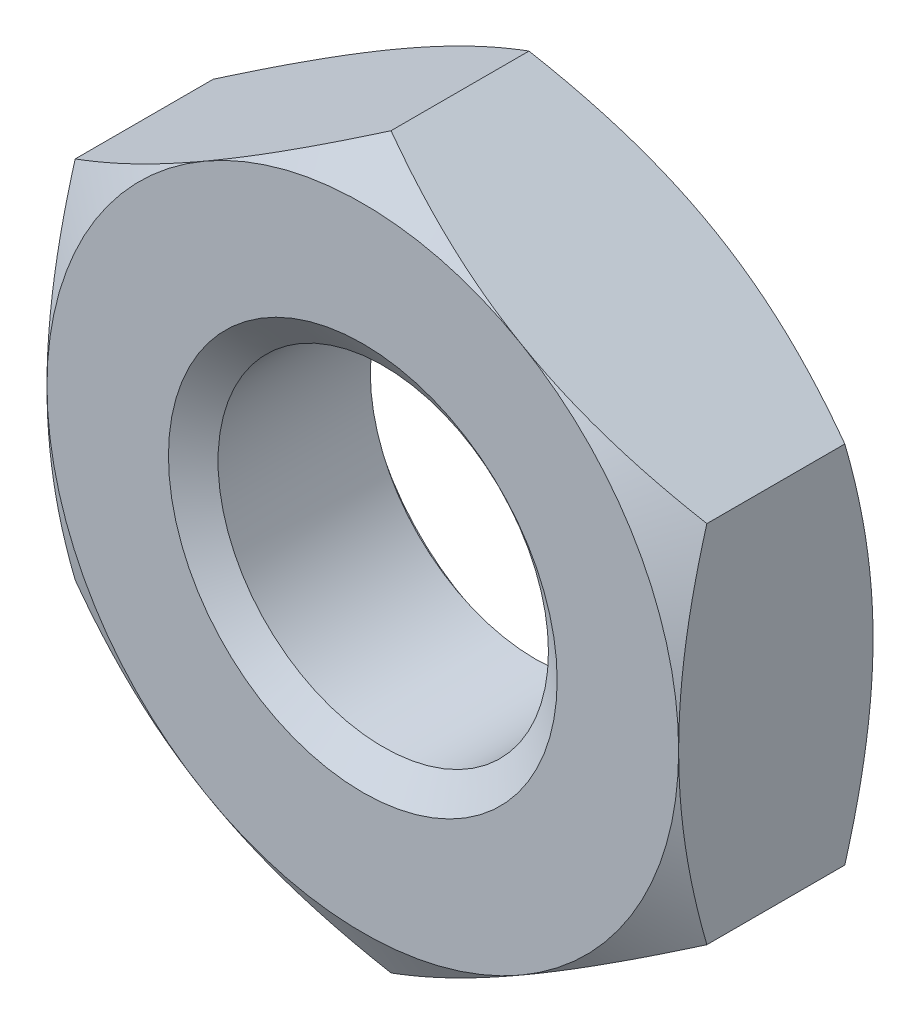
ISO-10303-21;
HEADER;
FILE_DESCRIPTION(('STEP AP214'),'2;1');
FILE_NAME('part.step','',(''),(''),'','','');
FILE_SCHEMA(('AUTOMOTIVE_DESIGN { 1 0 10303 214 1 1 1 1 }'));
ENDSEC;
DATA;
#1=APPLICATION_CONTEXT('core data for automotive mechanical design processes');
#2=APPLICATION_PROTOCOL_DEFINITION('international standard','automotive_design',2000,#1);
#3=PRODUCT_CONTEXT('',#1,'mechanical');
#4=PRODUCT('Part','Part','',(#3));
#5=PRODUCT_RELATED_PRODUCT_CATEGORY('part','',(#4));
#6=PRODUCT_DEFINITION_FORMATION('','',#4);
#7=PRODUCT_DEFINITION_CONTEXT('part definition',#1,'design');
#8=PRODUCT_DEFINITION('design','',#6,#7);
#9=PRODUCT_DEFINITION_SHAPE('','',#8);
#10=(LENGTH_UNIT() NAMED_UNIT(*) SI_UNIT(.MILLI.,.METRE.));
#11=(NAMED_UNIT(*) PLANE_ANGLE_UNIT() SI_UNIT($,.RADIAN.));
#12=(NAMED_UNIT(*) SI_UNIT($,.STERADIAN.) SOLID_ANGLE_UNIT());
#13=UNCERTAINTY_MEASURE_WITH_UNIT(LENGTH_MEASURE(1.E-05),#10,'distance_accuracy_value','');
#14=(GEOMETRIC_REPRESENTATION_CONTEXT(3) GLOBAL_UNCERTAINTY_ASSIGNED_CONTEXT((#13)) GLOBAL_UNIT_ASSIGNED_CONTEXT((#10,
#11,#12)) REPRESENTATION_CONTEXT('',''));
#15=CARTESIAN_POINT('',(0.,0.,0.));
#16=DIRECTION('',(0.,0.,1.));
#17=DIRECTION('',(1.,0.,0.));
#18=AXIS2_PLACEMENT_3D('',#15,#16,#17);
#19=CARTESIAN_POINT('',(0.,0.,-4.));
#20=DIRECTION('',(0.,0.,1.));
#21=DIRECTION('',(1.,0.,0.));
#22=AXIS2_PLACEMENT_3D('',#19,#20,#21);
#23=CYLINDRICAL_SURFACE('',#22,3.4);
#24=CARTESIAN_POINT('',(0.,0.,-0.420124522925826));
#25=DIRECTION('',(0.,0.,1.));
#26=DIRECTION('',(1.,0.,0.));
#27=AXIS2_PLACEMENT_3D('',#24,#25,#26);
#28=CIRCLE('',#27,3.4);
#29=CARTESIAN_POINT('',(3.4,0.,-0.420124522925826));
#30=VERTEX_POINT('',#29);
#31=EDGE_CURVE('E174',#30,#30,#28,.F.);
#32=ORIENTED_EDGE('',*,*,#31,.F.);
#33=EDGE_LOOP('',(#32));
#34=FACE_BOUND('',#33,.T.);
#35=CARTESIAN_POINT('',(0.,0.,-3.55447547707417));
#36=DIRECTION('',(0.,0.,-1.));
#37=DIRECTION('',(-1.,0.,0.));
#38=AXIS2_PLACEMENT_3D('',#35,#36,#37);
#39=CIRCLE('',#38,3.4);
#40=CARTESIAN_POINT('',(-3.4,0.,-3.55447547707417));
#41=VERTEX_POINT('',#40);
#42=EDGE_CURVE('E38',#41,#41,#39,.F.);
#43=ORIENTED_EDGE('',*,*,#42,.F.);
#44=EDGE_LOOP('',(#43));
#45=FACE_BOUND('',#44,.T.);
#46=ADVANCED_FACE('F33',(#34,#45),#23,.F.);
#47=CARTESIAN_POINT('',(0.,7.50555349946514,-4.));
#48=DIRECTION('',(-0.500000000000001,0.866025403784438,0.));
#49=DIRECTION('',(-0.866025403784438,-0.500000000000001,0.));
#50=AXIS2_PLACEMENT_3D('',#47,#48,#49);
#51=PLANE('',#50);
#52=DIRECTION('',(0.,0.,1.));
#53=VECTOR('',#52,1.);
#54=CARTESIAN_POINT('',(-6.5,3.75277674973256,-4.));
#55=LINE('',#54,#53);
#56=CARTESIAN_POINT('',(-6.5,3.75277674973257,-3.41944341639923));
#57=VERTEX_POINT('',#56);
#58=CARTESIAN_POINT('',(-6.5,3.75277674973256,-0.580556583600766));
#59=VERTEX_POINT('',#58);
#60=EDGE_CURVE('E164',#57,#59,#55,.T.);
#61=ORIENTED_EDGE('',*,*,#60,.T.);
#62=CARTESIAN_POINT('',(-6.5002,3.75266127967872,-0.58062325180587));
#63=CARTESIAN_POINT('',(-6.35732254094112,3.8351516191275,-0.533004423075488));
#64=CARTESIAN_POINT('',(-6.21391236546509,3.91794952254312,-0.487546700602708));
#65=CARTESIAN_POINT('',(-5.9259273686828,4.08421773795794,-0.401548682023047));
#66=CARTESIAN_POINT('',(-5.78135207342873,4.16768832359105,-0.361010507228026));
#67=CARTESIAN_POINT('',(-5.34531134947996,4.41943655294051,-0.247571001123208));
#68=CARTESIAN_POINT('',(-5.05212471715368,4.58870793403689,-0.183047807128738));
#69=CARTESIAN_POINT('',(-4.61337625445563,4.84201947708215,-0.107386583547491));
#70=CARTESIAN_POINT('',(-4.46912536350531,4.92530276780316,-0.085832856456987));
#71=CARTESIAN_POINT('',(-4.17997178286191,5.09224566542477,-0.0496903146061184));
#72=CARTESIAN_POINT('',(-4.03506915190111,5.17590523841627,-0.0351008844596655));
#73=CARTESIAN_POINT('',(-3.74501222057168,5.34336968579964,-0.0132587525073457));
#74=CARTESIAN_POINT('',(-3.59985839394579,5.427174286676,-0.00599772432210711));
#75=CARTESIAN_POINT('',(-3.30942466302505,5.59485627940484,0.00103969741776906));
#76=CARTESIAN_POINT('',(-3.16414476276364,5.6787336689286,0.000816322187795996));
#77=CARTESIAN_POINT('',(-2.7661240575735,5.90853103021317,-0.0100834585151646));
#78=CARTESIAN_POINT('',(-2.51351353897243,6.05437578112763,-0.0283818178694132));
#79=CARTESIAN_POINT('',(-2.00997032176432,6.34509659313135,-0.0864063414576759));
#80=CARTESIAN_POINT('',(-1.75903939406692,6.48997163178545,-0.126152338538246));
#81=CARTESIAN_POINT('',(-1.25448277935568,6.78127752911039,-0.225505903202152));
#82=CARTESIAN_POINT('',(-1.00092075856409,6.92767163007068,-0.28553442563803));
#83=CARTESIAN_POINT('',(-0.497578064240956,7.21827667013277,-0.421774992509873));
#84=CARTESIAN_POINT('',(-0.247790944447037,7.36249133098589,-0.497955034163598));
#85=CARTESIAN_POINT('',(0.000199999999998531,7.50566896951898,-0.580623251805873));
#86=B_SPLINE_CURVE_WITH_KNOTS('',3,(#62,#63,#64,#65,#66,#67,#68,#69,#70,#71,#72,#73,#74,#75,#76,
#77,#78,#79,#80,#81,#82,#83,#84,#85),.UNSPECIFIED.,.F.,.F.,(4,2,2,2,2,2,2,2,2,2,2,4),(0.,
0.515105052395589,1.03043143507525,2.06322554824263,2.56697389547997,3.07067772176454,
3.57380860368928,4.07692394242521,4.95279354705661,5.82947446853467,6.72559912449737,
7.61996451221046),.UNSPECIFIED.);
#87=CARTESIAN_POINT('',(-3.25000000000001,5.62916512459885,0.));
#88=VERTEX_POINT('',#87);
#89=EDGE_CURVE('E60',#59,#88,#86,.T.);
#90=ORIENTED_EDGE('',*,*,#89,.T.);
#91=CARTESIAN_POINT('',(0.,7.50555349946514,-0.580556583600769));
#92=VERTEX_POINT('',#91);
#93=EDGE_CURVE('E243',#88,#92,#86,.T.);
#94=ORIENTED_EDGE('',*,*,#93,.T.);
#95=DIRECTION('',(0.,0.,1.));
#96=VECTOR('',#95,1.);
#97=CARTESIAN_POINT('',(0.,7.50555349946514,-4.));
#98=LINE('',#97,#96);
#99=CARTESIAN_POINT('',(0.,7.50555349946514,-3.41944341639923));
#100=VERTEX_POINT('',#99);
#101=EDGE_CURVE('E149',#100,#92,#98,.T.);
#102=ORIENTED_EDGE('',*,*,#101,.F.);
#103=CARTESIAN_POINT('',(-6.5002,3.75266127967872,-3.41937674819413));
#104=CARTESIAN_POINT('',(-6.35732254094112,3.8351516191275,-3.46699557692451));
#105=CARTESIAN_POINT('',(-6.21391236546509,3.91794952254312,-3.51245329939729));
#106=CARTESIAN_POINT('',(-5.9259273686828,4.08421773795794,-3.59845131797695));
#107=CARTESIAN_POINT('',(-5.78135207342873,4.16768832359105,-3.63898949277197));
#108=CARTESIAN_POINT('',(-5.34531134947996,4.41943655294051,-3.75242899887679));
#109=CARTESIAN_POINT('',(-5.05212471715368,4.58870793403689,-3.81695219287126));
#110=CARTESIAN_POINT('',(-4.61337625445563,4.84201947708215,-3.89261341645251));
#111=CARTESIAN_POINT('',(-4.46912536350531,4.92530276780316,-3.91416714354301));
#112=CARTESIAN_POINT('',(-4.17997178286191,5.09224566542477,-3.95030968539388));
#113=CARTESIAN_POINT('',(-4.03506915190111,5.17590523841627,-3.96489911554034));
#114=CARTESIAN_POINT('',(-3.74501222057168,5.34336968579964,-3.98674124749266));
#115=CARTESIAN_POINT('',(-3.59985839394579,5.427174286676,-3.99400227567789));
#116=CARTESIAN_POINT('',(-3.30942466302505,5.59485627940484,-4.00103969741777));
#117=CARTESIAN_POINT('',(-3.16414476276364,5.6787336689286,-4.0008163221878));
#118=CARTESIAN_POINT('',(-2.7661240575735,5.90853103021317,-3.98991654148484));
#119=CARTESIAN_POINT('',(-2.51351353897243,6.05437578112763,-3.97161818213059));
#120=CARTESIAN_POINT('',(-2.00997032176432,6.34509659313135,-3.91359365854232));
#121=CARTESIAN_POINT('',(-1.75903939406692,6.48997163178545,-3.87384766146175));
#122=CARTESIAN_POINT('',(-1.25448277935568,6.78127752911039,-3.77449409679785));
#123=CARTESIAN_POINT('',(-1.00092075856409,6.92767163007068,-3.71446557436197));
#124=CARTESIAN_POINT('',(-0.497578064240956,7.21827667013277,-3.57822500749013));
#125=CARTESIAN_POINT('',(-0.247790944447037,7.36249133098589,-3.5020449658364));
#126=CARTESIAN_POINT('',(0.000199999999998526,7.50566896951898,-3.41937674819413));
#127=B_SPLINE_CURVE_WITH_KNOTS('',3,(#103,#104,#105,#106,#107,#108,#109,#110,#111,#112,#113,
#114,#115,#116,#117,#118,#119,#120,#121,#122,#123,#124,#125,#126),.UNSPECIFIED.,.F.,.F.,(4,2,2,
2,2,2,2,2,2,2,2,4),(0.,0.515105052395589,1.03043143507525,2.06322554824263,2.56697389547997,
3.07067772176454,3.57380860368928,4.07692394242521,4.95279354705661,5.82947446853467,
6.72559912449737,7.61996451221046),.UNSPECIFIED.);
#128=CARTESIAN_POINT('',(-3.25000000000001,5.62916512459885,-4.));
#129=VERTEX_POINT('',#128);
#130=EDGE_CURVE('E167',#129,#100,#127,.T.);
#131=ORIENTED_EDGE('',*,*,#130,.F.);
#132=EDGE_CURVE('E266',#57,#129,#127,.T.);
#133=ORIENTED_EDGE('',*,*,#132,.F.);
#134=EDGE_LOOP('',(#61,#90,#94,#102,#131,#133));
#135=FACE_BOUND('',#134,.T.);
#136=ADVANCED_FACE('F35',(#135),#51,.T.);
#137=CARTESIAN_POINT('',(6.5,3.75277674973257,-4.));
#138=DIRECTION('',(0.5,0.866025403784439,0.));
#139=DIRECTION('',(-0.866025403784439,0.5,0.));
#140=AXIS2_PLACEMENT_3D('',#137,#138,#139);
#141=PLANE('',#140);
#142=ORIENTED_EDGE('',*,*,#101,.T.);
#143=CARTESIAN_POINT('',(-0.000200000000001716,7.50566896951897,-0.580623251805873));
#144=CARTESIAN_POINT('',(0.142677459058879,7.4231786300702,-0.533004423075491));
#145=CARTESIAN_POINT('',(0.286087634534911,7.34038072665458,-0.487546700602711));
#146=CARTESIAN_POINT('',(0.574072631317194,7.17411251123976,-0.40154868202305));
#147=CARTESIAN_POINT('',(0.718647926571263,7.09064192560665,-0.361010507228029));
#148=CARTESIAN_POINT('',(1.15468865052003,6.83889369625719,-0.24757100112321));
#149=CARTESIAN_POINT('',(1.44787528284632,6.66962231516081,-0.18304780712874));
#150=CARTESIAN_POINT('',(1.88662374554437,6.41631077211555,-0.107386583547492));
#151=CARTESIAN_POINT('',(2.03087463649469,6.33302748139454,-0.0858328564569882));
#152=CARTESIAN_POINT('',(2.32002821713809,6.16608458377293,-0.0496903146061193));
#153=CARTESIAN_POINT('',(2.46493084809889,6.08242501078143,-0.0351008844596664));
#154=CARTESIAN_POINT('',(2.75498777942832,5.91496056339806,-0.0132587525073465));
#155=CARTESIAN_POINT('',(2.90014160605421,5.8311559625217,-0.00599772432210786));
#156=CARTESIAN_POINT('',(3.19057533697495,5.66347396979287,0.00103969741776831));
#157=CARTESIAN_POINT('',(3.33585523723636,5.5795965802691,0.000816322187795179));
#158=CARTESIAN_POINT('',(3.7338759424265,5.34979921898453,-0.0100834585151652));
#159=CARTESIAN_POINT('',(3.98648646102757,5.20395446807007,-0.0283818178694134));
#160=CARTESIAN_POINT('',(4.49002967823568,4.91323365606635,-0.0864063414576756));
#161=CARTESIAN_POINT('',(4.74096060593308,4.76835861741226,-0.126152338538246));
#162=CARTESIAN_POINT('',(5.24551722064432,4.47705272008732,-0.225505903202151));
#163=CARTESIAN_POINT('',(5.49907924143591,4.33065861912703,-0.285534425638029));
#164=CARTESIAN_POINT('',(6.00242193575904,4.04005357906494,-0.421774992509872));
#165=CARTESIAN_POINT('',(6.25220905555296,3.89583891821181,-0.497955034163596));
#166=CARTESIAN_POINT('',(6.5002,3.75266127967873,-0.580623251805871));
#167=B_SPLINE_CURVE_WITH_KNOTS('',3,(#143,#144,#145,#146,#147,#148,#149,#150,#151,#152,#153,
#154,#155,#156,#157,#158,#159,#160,#161,#162,#163,#164,#165,#166),.UNSPECIFIED.,.F.,.F.,(4,2,2,
2,2,2,2,2,2,2,2,4),(0.,0.515105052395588,1.03043143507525,2.06322554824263,2.56697389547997,
3.07067772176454,3.57380860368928,4.07692394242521,4.95279354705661,5.82947446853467,
6.72559912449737,7.61996451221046),.UNSPECIFIED.);
#168=CARTESIAN_POINT('',(3.25,5.62916512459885,0.));
#169=VERTEX_POINT('',#168);
#170=EDGE_CURVE('E142',#92,#169,#167,.T.);
#171=ORIENTED_EDGE('',*,*,#170,.T.);
#172=CARTESIAN_POINT('',(6.5,3.75277674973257,-0.580556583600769));
#173=VERTEX_POINT('',#172);
#174=EDGE_CURVE('E128',#169,#173,#167,.T.);
#175=ORIENTED_EDGE('',*,*,#174,.T.);
#176=DIRECTION('',(0.,0.,1.));
#177=VECTOR('',#176,1.);
#178=CARTESIAN_POINT('',(6.5,3.75277674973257,-4.));
#179=LINE('',#178,#177);
#180=CARTESIAN_POINT('',(6.5,3.75277674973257,-3.41944341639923));
#181=VERTEX_POINT('',#180);
#182=EDGE_CURVE('E141',#181,#173,#179,.T.);
#183=ORIENTED_EDGE('',*,*,#182,.F.);
#184=CARTESIAN_POINT('',(-0.000200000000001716,7.50566896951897,-3.41937674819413));
#185=CARTESIAN_POINT('',(0.142677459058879,7.4231786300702,-3.46699557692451));
#186=CARTESIAN_POINT('',(0.286087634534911,7.34038072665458,-3.51245329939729));
#187=CARTESIAN_POINT('',(0.574072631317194,7.17411251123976,-3.59845131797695));
#188=CARTESIAN_POINT('',(0.718647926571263,7.09064192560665,-3.63898949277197));
#189=CARTESIAN_POINT('',(1.15468865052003,6.83889369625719,-3.75242899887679));
#190=CARTESIAN_POINT('',(1.44787528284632,6.66962231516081,-3.81695219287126));
#191=CARTESIAN_POINT('',(1.88662374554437,6.41631077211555,-3.89261341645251));
#192=CARTESIAN_POINT('',(2.03087463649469,6.33302748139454,-3.91416714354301));
#193=CARTESIAN_POINT('',(2.32002821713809,6.16608458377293,-3.95030968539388));
#194=CARTESIAN_POINT('',(2.46493084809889,6.08242501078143,-3.96489911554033));
#195=CARTESIAN_POINT('',(2.75498777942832,5.91496056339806,-3.98674124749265));
#196=CARTESIAN_POINT('',(2.90014160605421,5.8311559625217,-3.99400227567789));
#197=CARTESIAN_POINT('',(3.19057533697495,5.66347396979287,-4.00103969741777));
#198=CARTESIAN_POINT('',(3.33585523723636,5.5795965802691,-4.0008163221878));
#199=CARTESIAN_POINT('',(3.7338759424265,5.34979921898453,-3.98991654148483));
#200=CARTESIAN_POINT('',(3.98648646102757,5.20395446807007,-3.97161818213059));
#201=CARTESIAN_POINT('',(4.49002967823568,4.91323365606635,-3.91359365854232));
#202=CARTESIAN_POINT('',(4.74096060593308,4.76835861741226,-3.87384766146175));
#203=CARTESIAN_POINT('',(5.24551722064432,4.47705272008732,-3.77449409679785));
#204=CARTESIAN_POINT('',(5.49907924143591,4.33065861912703,-3.71446557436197));
#205=CARTESIAN_POINT('',(6.00242193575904,4.04005357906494,-3.57822500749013));
#206=CARTESIAN_POINT('',(6.25220905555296,3.89583891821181,-3.5020449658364));
#207=CARTESIAN_POINT('',(6.5002,3.75266127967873,-3.41937674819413));
#208=B_SPLINE_CURVE_WITH_KNOTS('',3,(#184,#185,#186,#187,#188,#189,#190,#191,#192,#193,#194,
#195,#196,#197,#198,#199,#200,#201,#202,#203,#204,#205,#206,#207),.UNSPECIFIED.,.F.,.F.,(4,2,2,
2,2,2,2,2,2,2,2,4),(0.,0.515105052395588,1.03043143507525,2.06322554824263,2.56697389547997,
3.07067772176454,3.57380860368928,4.07692394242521,4.95279354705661,5.82947446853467,
6.72559912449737,7.61996451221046),.UNSPECIFIED.);
#209=CARTESIAN_POINT('',(3.25,5.62916512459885,-4.));
#210=VERTEX_POINT('',#209);
#211=EDGE_CURVE('E259',#210,#181,#208,.T.);
#212=ORIENTED_EDGE('',*,*,#211,.F.);
#213=EDGE_CURVE('E265',#100,#210,#208,.T.);
#214=ORIENTED_EDGE('',*,*,#213,.F.);
#215=EDGE_LOOP('',(#142,#171,#175,#183,#212,#214));
#216=FACE_BOUND('',#215,.T.);
#217=ADVANCED_FACE('F139',(#216),#141,.T.);
#218=CARTESIAN_POINT('',(6.5,3.75277674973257,-4.));
#219=DIRECTION('',(-1.,0.,0.));
#220=DIRECTION('',(0.,0.,1.));
#221=AXIS2_PLACEMENT_3D('',#218,#219,#220);
#222=PLANE('',#221);
#223=CARTESIAN_POINT('',(6.5,-9.95291698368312,-3.11042358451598));
#224=CARTESIAN_POINT('',(6.5,-9.66753022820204,-2.97250893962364));
#225=CARTESIAN_POINT('',(6.5,-9.38146872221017,-2.83596528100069));
#226=CARTESIAN_POINT('',(6.5,-8.80763137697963,-2.56640336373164));
#227=CARTESIAN_POINT('',(6.5,-8.51985525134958,-2.43338571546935));
#228=CARTESIAN_POINT('',(6.5,-7.94066929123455,-2.17095850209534));
#229=CARTESIAN_POINT('',(6.5,-7.64924808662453,-2.04157394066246));
#230=CARTESIAN_POINT('',(6.5,-7.06401043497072,-1.78836220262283));
#231=CARTESIAN_POINT('',(6.5,-6.77019411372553,-1.66453473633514));
#232=CARTESIAN_POINT('',(6.5,-6.17605150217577,-1.42244480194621));
#233=CARTESIAN_POINT('',(6.5,-5.87568957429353,-1.30426931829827));
#234=CARTESIAN_POINT('',(6.5,-5.27142269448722,-1.07717389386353));
#235=CARTESIAN_POINT('',(6.5,-4.96751735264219,-0.968254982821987));
#236=CARTESIAN_POINT('',(6.5,-4.3563054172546,-0.76259902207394));
#237=CARTESIAN_POINT('',(6.5,-4.04900762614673,-0.665836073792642));
#238=CARTESIAN_POINT('',(6.5,-3.43004022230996,-0.487635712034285));
#239=CARTESIAN_POINT('',(6.5,-3.11837202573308,-0.40619345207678));
#240=CARTESIAN_POINT('',(6.5,-2.49046594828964,-0.262584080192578));
#241=CARTESIAN_POINT('',(6.5,-2.17422687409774,-0.200422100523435));
#242=CARTESIAN_POINT('',(6.5,-1.5378916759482,-0.0995742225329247));
#243=CARTESIAN_POINT('',(6.5,-1.21779554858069,-0.0608883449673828));
#244=CARTESIAN_POINT('',(6.5,-0.737141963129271,-0.0229465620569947));
#245=CARTESIAN_POINT('',(6.5,-0.577336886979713,-0.013645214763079));
#246=CARTESIAN_POINT('',(6.5,-0.257468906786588,-0.00181408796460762));
#247=CARTESIAN_POINT('',(6.5,-0.097406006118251,0.000715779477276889));
#248=CARTESIAN_POINT('',(6.5,0.222635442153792,-0.00106401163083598));
#249=CARTESIAN_POINT('',(6.5,0.38261400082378,-0.00537175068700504));
#250=CARTESIAN_POINT('',(6.5,0.702250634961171,-0.0207175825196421));
#251=CARTESIAN_POINT('',(6.5,0.861908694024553,-0.0317560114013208));
#252=CARTESIAN_POINT('',(6.5,1.24887053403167,-0.06643686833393));
#253=CARTESIAN_POINT('',(6.5,1.47587694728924,-0.0934518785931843));
#254=CARTESIAN_POINT('',(6.5,1.92815030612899,-0.159589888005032));
#255=CARTESIAN_POINT('',(6.5,2.15341675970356,-0.198716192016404));
#256=CARTESIAN_POINT('',(6.5,2.60202427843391,-0.2876891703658));
#257=CARTESIAN_POINT('',(6.5,2.82536331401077,-0.337545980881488));
#258=CARTESIAN_POINT('',(6.5,3.26974354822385,-0.446458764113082));
#259=CARTESIAN_POINT('',(6.5,3.49078496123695,-0.505513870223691));
#260=CARTESIAN_POINT('',(6.5,3.93601414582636,-0.632954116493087));
#261=CARTESIAN_POINT('',(6.5,4.16014622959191,-0.701532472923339));
#262=CARTESIAN_POINT('',(6.5,4.60604131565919,-0.845465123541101));
#263=CARTESIAN_POINT('',(6.5,4.82780583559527,-0.920814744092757));
#264=CARTESIAN_POINT('',(6.5,5.26807593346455,-1.07673350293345));
#265=CARTESIAN_POINT('',(6.5,5.48659282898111,-1.15727087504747));
#266=CARTESIAN_POINT('',(6.5,5.9219312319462,-1.32307270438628));
#267=CARTESIAN_POINT('',(6.5,6.13875201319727,-1.40833907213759));
#268=CARTESIAN_POINT('',(6.5,6.35478510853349,-1.49550213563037));
#269=B_SPLINE_CURVE_WITH_KNOTS('',3,(#223,#224,#225,#226,#227,#228,#229,#230,#231,#232,#233,
#234,#235,#236,#237,#238,#239,#240,#241,#242,#243,#244,#245,#246,#247,#248,#249,#250,#251,#252,
#253,#254,#255,#256,#257,#258,#259,#260,#261,#262,#263,#264,#265,#266,#267,#268),.UNSPECIFIED.,
.F.,.F.,(4,2,2,2,2,2,2,2,2,2,2,2,2,2,2,2,2,2,2,2,2,2,4),(0.,0.950904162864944,1.90197187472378,
2.85848216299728,3.81494253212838,4.78314526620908,5.75145556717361,6.71766655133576,
7.68357137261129,8.64973308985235,9.61589566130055,10.0960003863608,10.5760988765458,
11.0560626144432,11.5360503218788,12.2214931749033,12.9071232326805,13.5934038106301,
14.2796197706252,14.9826563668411,15.6852113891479,16.3838119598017,17.082696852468),.UNSPECIFIED.);
#270=CARTESIAN_POINT('',(6.5,-3.75277674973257,-0.580556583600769));
#271=VERTEX_POINT('',#270);
#272=CARTESIAN_POINT('',(6.5,0.,0.));
#273=VERTEX_POINT('',#272);
#274=EDGE_CURVE('E134',#271,#273,#269,.T.);
#275=ORIENTED_EDGE('',*,*,#274,.F.);
#276=DIRECTION('',(0.,0.,1.));
#277=VECTOR('',#276,1.);
#278=CARTESIAN_POINT('',(6.5,-3.75277674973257,-4.));
#279=LINE('',#278,#277);
#280=CARTESIAN_POINT('',(6.5,-3.75277674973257,-3.41944341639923));
#281=VERTEX_POINT('',#280);
#282=EDGE_CURVE('E150',#281,#271,#279,.T.);
#283=ORIENTED_EDGE('',*,*,#282,.F.);
#284=CARTESIAN_POINT('',(6.5,-9.95291698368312,-0.889576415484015));
#285=CARTESIAN_POINT('',(6.5,-9.66753022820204,-1.02749106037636));
#286=CARTESIAN_POINT('',(6.5,-9.38146872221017,-1.16403471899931));
#287=CARTESIAN_POINT('',(6.5,-8.80763137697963,-1.43359663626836));
#288=CARTESIAN_POINT('',(6.5,-8.51985525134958,-1.56661428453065));
#289=CARTESIAN_POINT('',(6.5,-7.94066929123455,-1.82904149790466));
#290=CARTESIAN_POINT('',(6.5,-7.64924808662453,-1.95842605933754));
#291=CARTESIAN_POINT('',(6.5,-7.06401043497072,-2.21163779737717));
#292=CARTESIAN_POINT('',(6.5,-6.77019411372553,-2.33546526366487));
#293=CARTESIAN_POINT('',(6.5,-6.17605150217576,-2.57755519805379));
#294=CARTESIAN_POINT('',(6.5,-5.87568957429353,-2.69573068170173));
#295=CARTESIAN_POINT('',(6.5,-5.27142269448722,-2.92282610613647));
#296=CARTESIAN_POINT('',(6.5,-4.96751735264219,-3.03174501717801));
#297=CARTESIAN_POINT('',(6.5,-4.3563054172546,-3.23740097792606));
#298=CARTESIAN_POINT('',(6.5,-4.04900762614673,-3.33416392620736));
#299=CARTESIAN_POINT('',(6.5,-3.43004022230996,-3.51236428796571));
#300=CARTESIAN_POINT('',(6.5,-3.11837202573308,-3.59380654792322));
#301=CARTESIAN_POINT('',(6.5,-2.49046594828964,-3.73741591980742));
#302=CARTESIAN_POINT('',(6.5,-2.17422687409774,-3.79957789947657));
#303=CARTESIAN_POINT('',(6.5,-1.5378916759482,-3.90042577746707));
#304=CARTESIAN_POINT('',(6.5,-1.21779554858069,-3.93911165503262));
#305=CARTESIAN_POINT('',(6.5,-0.737141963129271,-3.97705343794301));
#306=CARTESIAN_POINT('',(6.5,-0.577336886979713,-3.98635478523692));
#307=CARTESIAN_POINT('',(6.5,-0.257468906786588,-3.99818591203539));
#308=CARTESIAN_POINT('',(6.5,-0.0974060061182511,-4.00071577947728));
#309=CARTESIAN_POINT('',(6.5,0.222635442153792,-3.99893598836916));
#310=CARTESIAN_POINT('',(6.5,0.382614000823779,-3.99462824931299));
#311=CARTESIAN_POINT('',(6.5,0.702250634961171,-3.97928241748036));
#312=CARTESIAN_POINT('',(6.5,0.861908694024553,-3.96824398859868));
#313=CARTESIAN_POINT('',(6.5,1.24887053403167,-3.93356313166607));
#314=CARTESIAN_POINT('',(6.5,1.47587694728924,-3.90654812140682));
#315=CARTESIAN_POINT('',(6.5,1.92815030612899,-3.84041011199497));
#316=CARTESIAN_POINT('',(6.5,2.15341675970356,-3.8012838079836));
#317=CARTESIAN_POINT('',(6.5,2.60202427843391,-3.7123108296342));
#318=CARTESIAN_POINT('',(6.5,2.82536331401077,-3.66245401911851));
#319=CARTESIAN_POINT('',(6.5,3.26974354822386,-3.55354123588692));
#320=CARTESIAN_POINT('',(6.5,3.49078496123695,-3.49448612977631));
#321=CARTESIAN_POINT('',(6.5,3.93601414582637,-3.36704588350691));
#322=CARTESIAN_POINT('',(6.5,4.16014622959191,-3.29846752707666));
#323=CARTESIAN_POINT('',(6.5,4.60604131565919,-3.1545348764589));
#324=CARTESIAN_POINT('',(6.5,4.82780583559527,-3.07918525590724));
#325=CARTESIAN_POINT('',(6.5,5.26807593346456,-2.92326649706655));
#326=CARTESIAN_POINT('',(6.5,5.48659282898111,-2.84272912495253));
#327=CARTESIAN_POINT('',(6.5,5.9219312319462,-2.67692729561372));
#328=CARTESIAN_POINT('',(6.5,6.13875201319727,-2.59166092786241));
#329=CARTESIAN_POINT('',(6.5,6.35478510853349,-2.50449786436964));
#330=B_SPLINE_CURVE_WITH_KNOTS('',3,(#284,#285,#286,#287,#288,#289,#290,#291,#292,#293,#294,
#295,#296,#297,#298,#299,#300,#301,#302,#303,#304,#305,#306,#307,#308,#309,#310,#311,#312,#313,
#314,#315,#316,#317,#318,#319,#320,#321,#322,#323,#324,#325,#326,#327,#328,#329),.UNSPECIFIED.,
.F.,.F.,(4,2,2,2,2,2,2,2,2,2,2,2,2,2,2,2,2,2,2,2,2,2,4),(0.,0.950904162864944,1.90197187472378,
2.85848216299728,3.81494253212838,4.78314526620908,5.75145556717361,6.71766655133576,
7.68357137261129,8.64973308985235,9.61589566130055,10.0960003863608,10.5760988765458,
11.0560626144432,11.5360503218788,12.2214931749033,12.9071232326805,13.5934038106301,
14.2796197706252,14.9826563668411,15.6852113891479,16.3838119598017,17.082696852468),.UNSPECIFIED.);
#331=CARTESIAN_POINT('',(6.5,0.,-4.));
#332=VERTEX_POINT('',#331);
#333=EDGE_CURVE('E272',#281,#332,#330,.T.);
#334=ORIENTED_EDGE('',*,*,#333,.T.);
#335=EDGE_CURVE('E148',#332,#181,#330,.T.);
#336=ORIENTED_EDGE('',*,*,#335,.T.);
#337=ORIENTED_EDGE('',*,*,#182,.T.);
#338=EDGE_CURVE('E125',#273,#173,#269,.T.);
#339=ORIENTED_EDGE('',*,*,#338,.F.);
#340=EDGE_LOOP('',(#275,#283,#334,#336,#337,#339));
#341=FACE_BOUND('',#340,.T.);
#342=ADVANCED_FACE('F145',(#341),#222,.F.);
#343=CARTESIAN_POINT('',(0.,-7.50555349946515,-4.));
#344=DIRECTION('',(0.500000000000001,-0.866025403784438,0.));
#345=DIRECTION('',(0.866025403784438,0.500000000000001,0.));
#346=AXIS2_PLACEMENT_3D('',#343,#344,#345);
#347=PLANE('',#346);
#348=ORIENTED_EDGE('',*,*,#282,.T.);
#349=CARTESIAN_POINT('',(6.5002,-3.75266127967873,-0.580623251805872));
#350=CARTESIAN_POINT('',(6.35732254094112,-3.83515161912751,-0.53300442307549));
#351=CARTESIAN_POINT('',(6.21391236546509,-3.91794952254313,-0.487546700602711));
#352=CARTESIAN_POINT('',(5.9259273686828,-4.08421773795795,-0.40154868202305));
#353=CARTESIAN_POINT('',(5.78135207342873,-4.16768832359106,-0.361010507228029));
#354=CARTESIAN_POINT('',(5.34531134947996,-4.41943655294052,-0.247571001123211));
#355=CARTESIAN_POINT('',(5.05212471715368,-4.5887079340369,-0.183047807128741));
#356=CARTESIAN_POINT('',(4.61337625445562,-4.84201947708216,-0.107386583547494));
#357=CARTESIAN_POINT('',(4.46912536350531,-4.92530276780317,-0.0858328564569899));
#358=CARTESIAN_POINT('',(4.17997178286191,-5.09224566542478,-0.0496903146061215));
#359=CARTESIAN_POINT('',(4.03506915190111,-5.17590523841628,-0.0351008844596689));
#360=CARTESIAN_POINT('',(3.74501222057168,-5.34336968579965,-0.0132587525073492));
#361=CARTESIAN_POINT('',(3.59985839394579,-5.42717428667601,-0.00599772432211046));
#362=CARTESIAN_POINT('',(3.30942466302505,-5.59485627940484,0.0010396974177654));
#363=CARTESIAN_POINT('',(3.16414476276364,-5.67873366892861,0.000816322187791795));
#364=CARTESIAN_POINT('',(2.7661240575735,-5.90853103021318,-0.0100834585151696));
#365=CARTESIAN_POINT('',(2.51351353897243,-6.05437578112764,-0.028381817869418));
#366=CARTESIAN_POINT('',(2.00997032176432,-6.34509659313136,-0.0864063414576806));
#367=CARTESIAN_POINT('',(1.75903939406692,-6.48997163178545,-0.126152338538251));
#368=CARTESIAN_POINT('',(1.25448277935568,-6.78127752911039,-0.225505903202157));
#369=CARTESIAN_POINT('',(1.00092075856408,-6.92767163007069,-0.285534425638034));
#370=CARTESIAN_POINT('',(0.497578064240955,-7.21827667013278,-0.421774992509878));
#371=CARTESIAN_POINT('',(0.247790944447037,-7.3624913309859,-0.497955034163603));
#372=CARTESIAN_POINT('',(-0.000199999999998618,-7.50566896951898,-0.580623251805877));
#373=B_SPLINE_CURVE_WITH_KNOTS('',3,(#349,#350,#351,#352,#353,#354,#355,#356,#357,#358,#359,
#360,#361,#362,#363,#364,#365,#366,#367,#368,#369,#370,#371,#372),.UNSPECIFIED.,.F.,.F.,(4,2,2,
2,2,2,2,2,2,2,2,4),(0.,0.515105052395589,1.03043143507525,2.06322554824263,2.56697389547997,
3.07067772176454,3.57380860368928,4.07692394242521,4.95279354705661,5.82947446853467,
6.72559912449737,7.61996451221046),.UNSPECIFIED.);
#374=CARTESIAN_POINT('',(3.25000000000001,-5.62916512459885,0.));
#375=VERTEX_POINT('',#374);
#376=EDGE_CURVE('E545',#271,#375,#373,.T.);
#377=ORIENTED_EDGE('',*,*,#376,.T.);
#378=CARTESIAN_POINT('',(0.,-7.50555349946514,-0.580556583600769));
#379=VERTEX_POINT('',#378);
#380=EDGE_CURVE('E227',#375,#379,#373,.T.);
#381=ORIENTED_EDGE('',*,*,#380,.T.);
#382=DIRECTION('',(0.,0.,1.));
#383=VECTOR('',#382,1.);
#384=CARTESIAN_POINT('',(0.,-7.50555349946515,-4.));
#385=LINE('',#384,#383);
#386=CARTESIAN_POINT('',(0.,-7.50555349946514,-3.41944341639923));
#387=VERTEX_POINT('',#386);
#388=EDGE_CURVE('E155',#387,#379,#385,.T.);
#389=ORIENTED_EDGE('',*,*,#388,.F.);
#390=CARTESIAN_POINT('',(6.5002,-3.75266127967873,-3.41937674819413));
#391=CARTESIAN_POINT('',(6.35732254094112,-3.83515161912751,-3.46699557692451));
#392=CARTESIAN_POINT('',(6.21391236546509,-3.91794952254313,-3.51245329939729));
#393=CARTESIAN_POINT('',(5.9259273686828,-4.08421773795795,-3.59845131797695));
#394=CARTESIAN_POINT('',(5.78135207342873,-4.16768832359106,-3.63898949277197));
#395=CARTESIAN_POINT('',(5.34531134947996,-4.41943655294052,-3.75242899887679));
#396=CARTESIAN_POINT('',(5.05212471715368,-4.5887079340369,-3.81695219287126));
#397=CARTESIAN_POINT('',(4.61337625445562,-4.84201947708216,-3.89261341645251));
#398=CARTESIAN_POINT('',(4.46912536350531,-4.92530276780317,-3.91416714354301));
#399=CARTESIAN_POINT('',(4.17997178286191,-5.09224566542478,-3.95030968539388));
#400=CARTESIAN_POINT('',(4.03506915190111,-5.17590523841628,-3.96489911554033));
#401=CARTESIAN_POINT('',(3.74501222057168,-5.34336968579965,-3.98674124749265));
#402=CARTESIAN_POINT('',(3.59985839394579,-5.42717428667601,-3.99400227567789));
#403=CARTESIAN_POINT('',(3.30942466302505,-5.59485627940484,-4.00103969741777));
#404=CARTESIAN_POINT('',(3.16414476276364,-5.67873366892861,-4.00081632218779));
#405=CARTESIAN_POINT('',(2.7661240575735,-5.90853103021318,-3.98991654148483));
#406=CARTESIAN_POINT('',(2.51351353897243,-6.05437578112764,-3.97161818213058));
#407=CARTESIAN_POINT('',(2.00997032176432,-6.34509659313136,-3.91359365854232));
#408=CARTESIAN_POINT('',(1.75903939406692,-6.48997163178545,-3.87384766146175));
#409=CARTESIAN_POINT('',(1.25448277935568,-6.78127752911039,-3.77449409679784));
#410=CARTESIAN_POINT('',(1.00092075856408,-6.92767163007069,-3.71446557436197));
#411=CARTESIAN_POINT('',(0.497578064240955,-7.21827667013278,-3.57822500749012));
#412=CARTESIAN_POINT('',(0.247790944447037,-7.3624913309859,-3.5020449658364));
#413=CARTESIAN_POINT('',(-0.000199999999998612,-7.50566896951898,-3.41937674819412));
#414=B_SPLINE_CURVE_WITH_KNOTS('',3,(#390,#391,#392,#393,#394,#395,#396,#397,#398,#399,#400,
#401,#402,#403,#404,#405,#406,#407,#408,#409,#410,#411,#412,#413),.UNSPECIFIED.,.F.,.F.,(4,2,2,
2,2,2,2,2,2,2,2,4),(0.,0.515105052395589,1.03043143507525,2.06322554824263,2.56697389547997,
3.07067772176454,3.57380860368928,4.07692394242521,4.95279354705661,5.82947446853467,
6.72559912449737,7.61996451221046),.UNSPECIFIED.);
#415=CARTESIAN_POINT('',(3.25000000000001,-5.62916512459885,-4.));
#416=VERTEX_POINT('',#415);
#417=EDGE_CURVE('E279',#416,#387,#414,.T.);
#418=ORIENTED_EDGE('',*,*,#417,.F.);
#419=EDGE_CURVE('E278',#281,#416,#414,.T.);
#420=ORIENTED_EDGE('',*,*,#419,.F.);
#421=EDGE_LOOP('',(#348,#377,#381,#389,#418,#420));
#422=FACE_BOUND('',#421,.T.);
#423=ADVANCED_FACE('F291',(#422),#347,.T.);
#424=CARTESIAN_POINT('',(-6.5,-3.75277674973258,-4.));
#425=DIRECTION('',(-0.5,-0.866025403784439,0.));
#426=DIRECTION('',(0.866025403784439,-0.5,0.));
#427=AXIS2_PLACEMENT_3D('',#424,#425,#426);
#428=PLANE('',#427);
#429=ORIENTED_EDGE('',*,*,#388,.T.);
#430=CARTESIAN_POINT('',(0.00020000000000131,-7.50566896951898,-0.580623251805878));
#431=CARTESIAN_POINT('',(-0.142677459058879,-7.42317863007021,-0.533004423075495));
#432=CARTESIAN_POINT('',(-0.286087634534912,-7.34038072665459,-0.487546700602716));
#433=CARTESIAN_POINT('',(-0.574072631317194,-7.17411251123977,-0.401548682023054));
#434=CARTESIAN_POINT('',(-0.718647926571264,-7.09064192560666,-0.361010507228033));
#435=CARTESIAN_POINT('',(-1.15468865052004,-6.8388936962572,-0.247571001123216));
#436=CARTESIAN_POINT('',(-1.44787528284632,-6.66962231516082,-0.183047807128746));
#437=CARTESIAN_POINT('',(-1.88662374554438,-6.41631077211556,-0.107386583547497));
#438=CARTESIAN_POINT('',(-2.03087463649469,-6.33302748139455,-0.0858328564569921));
#439=CARTESIAN_POINT('',(-2.32002821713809,-6.16608458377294,-0.0496903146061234));
#440=CARTESIAN_POINT('',(-2.46493084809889,-6.08242501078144,-0.0351008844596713));
#441=CARTESIAN_POINT('',(-2.75498777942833,-5.91496056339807,-0.0132587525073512));
#442=CARTESIAN_POINT('',(-2.90014160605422,-5.83115596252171,-0.00599772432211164));
#443=CARTESIAN_POINT('',(-3.19057533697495,-5.66347396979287,0.00103969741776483));
#444=CARTESIAN_POINT('',(-3.33585523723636,-5.57959658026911,0.000816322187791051));
#445=CARTESIAN_POINT('',(-3.7338759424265,-5.34979921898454,-0.01008345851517));
#446=CARTESIAN_POINT('',(-3.98648646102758,-5.20395446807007,-0.0283818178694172));
#447=CARTESIAN_POINT('',(-4.49002967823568,-4.91323365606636,-0.0864063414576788));
#448=CARTESIAN_POINT('',(-4.74096060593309,-4.76835861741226,-0.126152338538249));
#449=CARTESIAN_POINT('',(-5.24551722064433,-4.47705272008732,-0.225505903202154));
#450=CARTESIAN_POINT('',(-5.49907924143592,-4.33065861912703,-0.285534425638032));
#451=CARTESIAN_POINT('',(-6.00242193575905,-4.04005357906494,-0.421774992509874));
#452=CARTESIAN_POINT('',(-6.25220905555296,-3.89583891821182,-0.497955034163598));
#453=CARTESIAN_POINT('',(-6.5002,-3.75266127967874,-0.580623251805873));
#454=B_SPLINE_CURVE_WITH_KNOTS('',3,(#430,#431,#432,#433,#434,#435,#436,#437,#438,#439,#440,
#441,#442,#443,#444,#445,#446,#447,#448,#449,#450,#451,#452,#453),.UNSPECIFIED.,.F.,.F.,(4,2,2,
2,2,2,2,2,2,2,2,4),(0.,0.515105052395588,1.03043143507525,2.06322554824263,2.56697389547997,
3.07067772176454,3.57380860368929,4.07692394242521,4.95279354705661,5.82947446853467,
6.72559912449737,7.61996451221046),.UNSPECIFIED.);
#455=CARTESIAN_POINT('',(-3.25,-5.62916512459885,0.));
#456=VERTEX_POINT('',#455);
#457=EDGE_CURVE('E543',#379,#456,#454,.T.);
#458=ORIENTED_EDGE('',*,*,#457,.T.);
#459=CARTESIAN_POINT('',(-6.5,-3.75277674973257,-0.580556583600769));
#460=VERTEX_POINT('',#459);
#461=EDGE_CURVE('E199',#456,#460,#454,.T.);
#462=ORIENTED_EDGE('',*,*,#461,.T.);
#463=DIRECTION('',(0.,0.,1.));
#464=VECTOR('',#463,1.);
#465=CARTESIAN_POINT('',(-6.5,-3.75277674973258,-4.));
#466=LINE('',#465,#464);
#467=CARTESIAN_POINT('',(-6.5,-3.75277674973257,-3.41944341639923));
#468=VERTEX_POINT('',#467);
#469=EDGE_CURVE('E161',#468,#460,#466,.T.);
#470=ORIENTED_EDGE('',*,*,#469,.F.);
#471=CARTESIAN_POINT('',(0.00020000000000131,-7.50566896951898,-3.41937674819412));
#472=CARTESIAN_POINT('',(-0.142677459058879,-7.42317863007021,-3.4669955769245));
#473=CARTESIAN_POINT('',(-0.286087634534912,-7.34038072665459,-3.51245329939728));
#474=CARTESIAN_POINT('',(-0.574072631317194,-7.17411251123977,-3.59845131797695));
#475=CARTESIAN_POINT('',(-0.718647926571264,-7.09064192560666,-3.63898949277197));
#476=CARTESIAN_POINT('',(-1.15468865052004,-6.8388936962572,-3.75242899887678));
#477=CARTESIAN_POINT('',(-1.44787528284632,-6.66962231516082,-3.81695219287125));
#478=CARTESIAN_POINT('',(-1.88662374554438,-6.41631077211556,-3.8926134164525));
#479=CARTESIAN_POINT('',(-2.03087463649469,-6.33302748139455,-3.91416714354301));
#480=CARTESIAN_POINT('',(-2.32002821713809,-6.16608458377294,-3.95030968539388));
#481=CARTESIAN_POINT('',(-2.46493084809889,-6.08242501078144,-3.96489911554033));
#482=CARTESIAN_POINT('',(-2.75498777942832,-5.91496056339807,-3.98674124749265));
#483=CARTESIAN_POINT('',(-2.90014160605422,-5.83115596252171,-3.99400227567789));
#484=CARTESIAN_POINT('',(-3.19057533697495,-5.66347396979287,-4.00103969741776));
#485=CARTESIAN_POINT('',(-3.33585523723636,-5.57959658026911,-4.00081632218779));
#486=CARTESIAN_POINT('',(-3.7338759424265,-5.34979921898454,-3.98991654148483));
#487=CARTESIAN_POINT('',(-3.98648646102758,-5.20395446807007,-3.97161818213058));
#488=CARTESIAN_POINT('',(-4.49002967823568,-4.91323365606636,-3.91359365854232));
#489=CARTESIAN_POINT('',(-4.74096060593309,-4.76835861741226,-3.87384766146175));
#490=CARTESIAN_POINT('',(-5.24551722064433,-4.47705272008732,-3.77449409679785));
#491=CARTESIAN_POINT('',(-5.49907924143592,-4.33065861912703,-3.71446557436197));
#492=CARTESIAN_POINT('',(-6.00242193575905,-4.04005357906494,-3.57822500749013));
#493=CARTESIAN_POINT('',(-6.25220905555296,-3.89583891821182,-3.5020449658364));
#494=CARTESIAN_POINT('',(-6.5002,-3.75266127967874,-3.41937674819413));
#495=B_SPLINE_CURVE_WITH_KNOTS('',3,(#471,#472,#473,#474,#475,#476,#477,#478,#479,#480,#481,
#482,#483,#484,#485,#486,#487,#488,#489,#490,#491,#492,#493,#494),.UNSPECIFIED.,.F.,.F.,(4,2,2,
2,2,2,2,2,2,2,2,4),(0.,0.515105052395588,1.03043143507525,2.06322554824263,2.56697389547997,
3.07067772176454,3.57380860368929,4.07692394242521,4.95279354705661,5.82947446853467,
6.72559912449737,7.61996451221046),.UNSPECIFIED.);
#496=CARTESIAN_POINT('',(-3.25,-5.62916512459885,-4.));
#497=VERTEX_POINT('',#496);
#498=EDGE_CURVE('E286',#497,#468,#495,.T.);
#499=ORIENTED_EDGE('',*,*,#498,.F.);
#500=EDGE_CURVE('E285',#387,#497,#495,.T.);
#501=ORIENTED_EDGE('',*,*,#500,.F.);
#502=EDGE_LOOP('',(#429,#458,#462,#470,#499,#501));
#503=FACE_BOUND('',#502,.T.);
#504=ADVANCED_FACE('F294',(#503),#428,.T.);
#505=CARTESIAN_POINT('',(-6.5,3.75277674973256,-4.));
#506=DIRECTION('',(-1.,0.,0.));
#507=DIRECTION('',(0.,0.,1.));
#508=AXIS2_PLACEMENT_3D('',#505,#506,#507);
#509=PLANE('',#508);
#510=ORIENTED_EDGE('',*,*,#469,.T.);
#511=CARTESIAN_POINT('',(-6.5,-9.95291698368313,-3.11042358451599));
#512=CARTESIAN_POINT('',(-6.5,-9.66753022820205,-2.97250893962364));
#513=CARTESIAN_POINT('',(-6.5,-9.38146872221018,-2.8359652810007));
#514=CARTESIAN_POINT('',(-6.5,-8.80763137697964,-2.56640336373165));
#515=CARTESIAN_POINT('',(-6.5,-8.51985525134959,-2.43338571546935));
#516=CARTESIAN_POINT('',(-6.5,-7.94066929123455,-2.17095850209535));
#517=CARTESIAN_POINT('',(-6.5,-7.64924808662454,-2.04157394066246));
#518=CARTESIAN_POINT('',(-6.5,-7.06401043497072,-1.78836220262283));
#519=CARTESIAN_POINT('',(-6.5,-6.77019411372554,-1.66453473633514));
#520=CARTESIAN_POINT('',(-6.5,-6.17605150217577,-1.42244480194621));
#521=CARTESIAN_POINT('',(-6.5,-5.87568957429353,-1.30426931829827));
#522=CARTESIAN_POINT('',(-6.5,-5.27142269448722,-1.07717389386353));
#523=CARTESIAN_POINT('',(-6.5,-4.96751735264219,-0.968254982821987));
#524=CARTESIAN_POINT('',(-6.5,-4.35630541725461,-0.76259902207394));
#525=CARTESIAN_POINT('',(-6.5,-4.04900762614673,-0.665836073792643));
#526=CARTESIAN_POINT('',(-6.5,-3.43004022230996,-0.487635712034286));
#527=CARTESIAN_POINT('',(-6.5,-3.11837202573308,-0.406193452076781));
#528=CARTESIAN_POINT('',(-6.5,-2.49046594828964,-0.262584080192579));
#529=CARTESIAN_POINT('',(-6.5,-2.17422687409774,-0.200422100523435));
#530=CARTESIAN_POINT('',(-6.5,-1.5378916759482,-0.0995742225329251));
#531=CARTESIAN_POINT('',(-6.5,-1.2177955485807,-0.0608883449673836));
#532=CARTESIAN_POINT('',(-6.5,-0.737141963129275,-0.0229465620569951));
#533=CARTESIAN_POINT('',(-6.5,-0.577336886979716,-0.0136452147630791));
#534=CARTESIAN_POINT('',(-6.5,-0.257468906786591,-0.00181408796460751));
#535=CARTESIAN_POINT('',(-6.5,-0.0974060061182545,0.000715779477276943));
#536=CARTESIAN_POINT('',(-6.5,0.222635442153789,-0.00106401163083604));
#537=CARTESIAN_POINT('',(-6.5,0.382614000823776,-0.00537175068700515));
#538=CARTESIAN_POINT('',(-6.5,0.702250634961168,-0.020717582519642));
#539=CARTESIAN_POINT('',(-6.5,0.861908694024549,-0.0317560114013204));
#540=CARTESIAN_POINT('',(-6.5,1.24887053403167,-0.0664368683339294));
#541=CARTESIAN_POINT('',(-6.5,1.47587694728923,-0.0934518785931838));
#542=CARTESIAN_POINT('',(-6.5,1.92815030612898,-0.159589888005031));
#543=CARTESIAN_POINT('',(-6.5,2.15341675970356,-0.198716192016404));
#544=CARTESIAN_POINT('',(-6.5,2.60202427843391,-0.2876891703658));
#545=CARTESIAN_POINT('',(-6.5,2.82536331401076,-0.337545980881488));
#546=CARTESIAN_POINT('',(-6.5,3.26974354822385,-0.446458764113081));
#547=CARTESIAN_POINT('',(-6.5,3.49078496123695,-0.505513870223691));
#548=CARTESIAN_POINT('',(-6.5,3.93601414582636,-0.632954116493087));
#549=CARTESIAN_POINT('',(-6.5,4.16014622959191,-0.701532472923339));
#550=CARTESIAN_POINT('',(-6.5,4.60604131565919,-0.845465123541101));
#551=CARTESIAN_POINT('',(-6.5,4.82780583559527,-0.920814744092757));
#552=CARTESIAN_POINT('',(-6.5,5.26807593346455,-1.07673350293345));
#553=CARTESIAN_POINT('',(-6.5,5.48659282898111,-1.15727087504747));
#554=CARTESIAN_POINT('',(-6.5,5.9219312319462,-1.32307270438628));
#555=CARTESIAN_POINT('',(-6.5,6.13875201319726,-1.40833907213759));
#556=CARTESIAN_POINT('',(-6.5,6.35478510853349,-1.49550213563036));
#557=B_SPLINE_CURVE_WITH_KNOTS('',3,(#511,#512,#513,#514,#515,#516,#517,#518,#519,#520,#521,
#522,#523,#524,#525,#526,#527,#528,#529,#530,#531,#532,#533,#534,#535,#536,#537,#538,#539,#540,
#541,#542,#543,#544,#545,#546,#547,#548,#549,#550,#551,#552,#553,#554,#555,#556),.UNSPECIFIED.,
.F.,.F.,(4,2,2,2,2,2,2,2,2,2,2,2,2,2,2,2,2,2,2,2,2,2,4),(0.,0.95090416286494,1.90197187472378,
2.85848216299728,3.81494253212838,4.78314526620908,5.75145556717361,6.71766655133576,
7.68357137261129,8.64973308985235,9.61589566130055,10.0960003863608,10.5760988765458,
11.0560626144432,11.5360503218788,12.2214931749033,12.9071232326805,13.5934038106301,
14.2796197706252,14.9826563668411,15.6852113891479,16.3838119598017,17.082696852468),.UNSPECIFIED.);
#558=CARTESIAN_POINT('',(-6.5,0.,0.));
#559=VERTEX_POINT('',#558);
#560=EDGE_CURVE('E198',#460,#559,#557,.T.);
#561=ORIENTED_EDGE('',*,*,#560,.T.);
#562=EDGE_CURVE('E191',#559,#59,#557,.T.);
#563=ORIENTED_EDGE('',*,*,#562,.T.);
#564=ORIENTED_EDGE('',*,*,#60,.F.);
#565=CARTESIAN_POINT('',(-6.5,-9.95291698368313,-0.889576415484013));
#566=CARTESIAN_POINT('',(-6.5,-9.66753022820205,-1.02749106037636));
#567=CARTESIAN_POINT('',(-6.5,-9.38146872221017,-1.1640347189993));
#568=CARTESIAN_POINT('',(-6.5,-8.80763137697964,-1.43359663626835));
#569=CARTESIAN_POINT('',(-6.5,-8.51985525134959,-1.56661428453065));
#570=CARTESIAN_POINT('',(-6.5,-7.94066929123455,-1.82904149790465));
#571=CARTESIAN_POINT('',(-6.5,-7.64924808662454,-1.95842605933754));
#572=CARTESIAN_POINT('',(-6.5,-7.06401043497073,-2.21163779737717));
#573=CARTESIAN_POINT('',(-6.5,-6.77019411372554,-2.33546526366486));
#574=CARTESIAN_POINT('',(-6.5,-6.17605150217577,-2.57755519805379));
#575=CARTESIAN_POINT('',(-6.5,-5.87568957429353,-2.69573068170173));
#576=CARTESIAN_POINT('',(-6.5,-5.27142269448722,-2.92282610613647));
#577=CARTESIAN_POINT('',(-6.5,-4.96751735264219,-3.03174501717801));
#578=CARTESIAN_POINT('',(-6.5,-4.35630541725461,-3.23740097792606));
#579=CARTESIAN_POINT('',(-6.5,-4.04900762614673,-3.33416392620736));
#580=CARTESIAN_POINT('',(-6.5,-3.43004022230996,-3.51236428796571));
#581=CARTESIAN_POINT('',(-6.5,-3.11837202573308,-3.59380654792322));
#582=CARTESIAN_POINT('',(-6.5,-2.49046594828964,-3.73741591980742));
#583=CARTESIAN_POINT('',(-6.5,-2.17422687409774,-3.79957789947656));
#584=CARTESIAN_POINT('',(-6.5,-1.5378916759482,-3.90042577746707));
#585=CARTESIAN_POINT('',(-6.5,-1.2177955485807,-3.93911165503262));
#586=CARTESIAN_POINT('',(-6.5,-0.737141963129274,-3.97705343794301));
#587=CARTESIAN_POINT('',(-6.5,-0.577336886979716,-3.98635478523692));
#588=CARTESIAN_POINT('',(-6.5,-0.257468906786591,-3.99818591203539));
#589=CARTESIAN_POINT('',(-6.5,-0.0974060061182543,-4.00071577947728));
#590=CARTESIAN_POINT('',(-6.5,0.222635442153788,-3.99893598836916));
#591=CARTESIAN_POINT('',(-6.5,0.382614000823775,-3.994628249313));
#592=CARTESIAN_POINT('',(-6.5,0.702250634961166,-3.97928241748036));
#593=CARTESIAN_POINT('',(-6.5,0.861908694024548,-3.96824398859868));
#594=CARTESIAN_POINT('',(-6.5,1.24887053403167,-3.93356313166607));
#595=CARTESIAN_POINT('',(-6.5,1.47587694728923,-3.90654812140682));
#596=CARTESIAN_POINT('',(-6.5,1.92815030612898,-3.84041011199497));
#597=CARTESIAN_POINT('',(-6.5,2.15341675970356,-3.8012838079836));
#598=CARTESIAN_POINT('',(-6.5,2.60202427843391,-3.7123108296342));
#599=CARTESIAN_POINT('',(-6.5,2.82536331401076,-3.66245401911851));
#600=CARTESIAN_POINT('',(-6.5,3.26974354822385,-3.55354123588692));
#601=CARTESIAN_POINT('',(-6.5,3.49078496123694,-3.49448612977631));
#602=CARTESIAN_POINT('',(-6.5,3.93601414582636,-3.36704588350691));
#603=CARTESIAN_POINT('',(-6.5,4.16014622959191,-3.29846752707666));
#604=CARTESIAN_POINT('',(-6.5,4.60604131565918,-3.1545348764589));
#605=CARTESIAN_POINT('',(-6.5,4.82780583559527,-3.07918525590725));
#606=CARTESIAN_POINT('',(-6.5,5.26807593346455,-2.92326649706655));
#607=CARTESIAN_POINT('',(-6.5,5.48659282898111,-2.84272912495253));
#608=CARTESIAN_POINT('',(-6.5,5.9219312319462,-2.67692729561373));
#609=CARTESIAN_POINT('',(-6.5,6.13875201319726,-2.59166092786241));
#610=CARTESIAN_POINT('',(-6.5,6.35478510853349,-2.50449786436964));
#611=B_SPLINE_CURVE_WITH_KNOTS('',3,(#565,#566,#567,#568,#569,#570,#571,#572,#573,#574,#575,
#576,#577,#578,#579,#580,#581,#582,#583,#584,#585,#586,#587,#588,#589,#590,#591,#592,#593,#594,
#595,#596,#597,#598,#599,#600,#601,#602,#603,#604,#605,#606,#607,#608,#609,#610),.UNSPECIFIED.,
.F.,.F.,(4,2,2,2,2,2,2,2,2,2,2,2,2,2,2,2,2,2,2,2,2,2,4),(0.,0.950904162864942,1.90197187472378,
2.85848216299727,3.81494253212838,4.78314526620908,5.75145556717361,6.71766655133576,
7.68357137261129,8.64973308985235,9.61589566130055,10.0960003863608,10.5760988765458,
11.0560626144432,11.5360503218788,12.2214931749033,12.9071232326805,13.5934038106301,
14.2796197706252,14.9826563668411,15.6852113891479,16.3838119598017,17.082696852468),.UNSPECIFIED.);
#612=CARTESIAN_POINT('',(-6.5,0.,-4.));
#613=VERTEX_POINT('',#612);
#614=EDGE_CURVE('E333',#613,#57,#611,.T.);
#615=ORIENTED_EDGE('',*,*,#614,.F.);
#616=EDGE_CURVE('E348',#468,#613,#611,.T.);
#617=ORIENTED_EDGE('',*,*,#616,.F.);
#618=EDGE_LOOP('',(#510,#561,#563,#564,#615,#617));
#619=FACE_BOUND('',#618,.T.);
#620=ADVANCED_FACE('F206',(#619),#509,.T.);
#621=CARTESIAN_POINT('',(-13.,0.,0.));
#622=DIRECTION('',(0.,0.,1.));
#623=DIRECTION('',(1.,0.,0.));
#624=AXIS2_PLACEMENT_3D('',#621,#622,#623);
#625=PLANE('',#624);
#626=CARTESIAN_POINT('',(0.,0.,0.));
#627=DIRECTION('',(0.,0.,1.));
#628=DIRECTION('',(1.,0.,0.));
#629=AXIS2_PLACEMENT_3D('',#626,#627,#628);
#630=CIRCLE('',#629,4.);
#631=CARTESIAN_POINT('',(4.,0.,0.));
#632=VERTEX_POINT('',#631);
#633=EDGE_CURVE('E176',#632,#632,#630,.T.);
#634=ORIENTED_EDGE('',*,*,#633,.F.);
#635=EDGE_LOOP('',(#634));
#636=FACE_BOUND('',#635,.T.);
#637=CARTESIAN_POINT('',(0.,0.,0.));
#638=DIRECTION('',(0.,0.,1.));
#639=DIRECTION('',(1.,0.,0.));
#640=AXIS2_PLACEMENT_3D('',#637,#638,#639);
#641=CIRCLE('',#640,6.5);
#642=EDGE_CURVE('E45',#375,#273,#641,.T.);
#643=ORIENTED_EDGE('',*,*,#642,.T.);
#644=CARTESIAN_POINT('',(0.,0.,0.));
#645=DIRECTION('',(0.,0.,1.));
#646=DIRECTION('',(1.,0.,0.));
#647=AXIS2_PLACEMENT_3D('',#644,#645,#646);
#648=CIRCLE('',#647,6.5);
#649=EDGE_CURVE('E52',#273,#169,#648,.T.);
#650=ORIENTED_EDGE('',*,*,#649,.T.);
#651=EDGE_CURVE('E11',#169,#88,#641,.T.);
#652=ORIENTED_EDGE('',*,*,#651,.T.);
#653=EDGE_CURVE('E43',#88,#559,#641,.T.);
#654=ORIENTED_EDGE('',*,*,#653,.T.);
#655=EDGE_CURVE('E369',#559,#456,#641,.T.);
#656=ORIENTED_EDGE('',*,*,#655,.T.);
#657=EDGE_CURVE('E173',#456,#375,#641,.T.);
#658=ORIENTED_EDGE('',*,*,#657,.T.);
#659=EDGE_LOOP('',(#643,#650,#652,#654,#656,#658));
#660=FACE_BOUND('',#659,.T.);
#661=ADVANCED_FACE('F255',(#636,#660),#625,.T.);
#662=CARTESIAN_POINT('',(-13.,0.,-4.));
#663=DIRECTION('',(0.,0.,1.));
#664=DIRECTION('',(1.,0.,0.));
#665=AXIS2_PLACEMENT_3D('',#662,#663,#664);
#666=PLANE('',#665);
#667=CARTESIAN_POINT('',(0.,0.,-4.));
#668=DIRECTION('',(0.,0.,1.));
#669=DIRECTION('',(1.,0.,0.));
#670=AXIS2_PLACEMENT_3D('',#667,#668,#669);
#671=CIRCLE('',#670,4.);
#672=CARTESIAN_POINT('',(4.,0.,-4.));
#673=VERTEX_POINT('',#672);
#674=EDGE_CURVE('E177',#673,#673,#671,.F.);
#675=ORIENTED_EDGE('',*,*,#674,.F.);
#676=EDGE_LOOP('',(#675));
#677=FACE_BOUND('',#676,.T.);
#678=CARTESIAN_POINT('',(0.,0.,-4.));
#679=DIRECTION('',(0.,0.,1.));
#680=DIRECTION('',(1.,0.,0.));
#681=AXIS2_PLACEMENT_3D('',#678,#679,#680);
#682=CIRCLE('',#681,6.5);
#683=EDGE_CURVE('E250',#332,#210,#682,.T.);
#684=ORIENTED_EDGE('',*,*,#683,.F.);
#685=CARTESIAN_POINT('',(0.,0.,-4.));
#686=DIRECTION('',(0.,0.,1.));
#687=DIRECTION('',(1.,0.,0.));
#688=AXIS2_PLACEMENT_3D('',#685,#686,#687);
#689=CIRCLE('',#688,6.5);
#690=EDGE_CURVE('E168',#332,#416,#689,.F.);
#691=ORIENTED_EDGE('',*,*,#690,.T.);
#692=EDGE_CURVE('E170',#416,#497,#689,.F.);
#693=ORIENTED_EDGE('',*,*,#692,.T.);
#694=EDGE_CURVE('E378',#497,#613,#689,.F.);
#695=ORIENTED_EDGE('',*,*,#694,.T.);
#696=EDGE_CURVE('E361',#613,#129,#689,.F.);
#697=ORIENTED_EDGE('',*,*,#696,.T.);
#698=EDGE_CURVE('E152',#129,#210,#689,.F.);
#699=ORIENTED_EDGE('',*,*,#698,.T.);
#700=EDGE_LOOP('',(#684,#691,#693,#695,#697,#699));
#701=FACE_BOUND('',#700,.T.);
#702=ADVANCED_FACE('F313',(#677,#701),#666,.F.);
#703=CARTESIAN_POINT('',(0.,0.,-4.));
#704=DIRECTION('',(0.,0.,1.));
#705=DIRECTION('',(1.,0.,0.));
#706=AXIS2_PLACEMENT_3D('',#703,#704,#705);
#707=CONICAL_SURFACE('',#706,6.5,1.0471975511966);
#708=ORIENTED_EDGE('',*,*,#211,.T.);
#709=ORIENTED_EDGE('',*,*,#335,.F.);
#710=ORIENTED_EDGE('',*,*,#683,.T.);
#711=EDGE_LOOP('',(#708,#709,#710));
#712=FACE_BOUND('',#711,.T.);
#713=ADVANCED_FACE('F315',(#712),#707,.T.);
#714=ORIENTED_EDGE('',*,*,#130,.T.);
#715=ORIENTED_EDGE('',*,*,#213,.T.);
#716=ORIENTED_EDGE('',*,*,#698,.F.);
#717=EDGE_LOOP('',(#714,#715,#716));
#718=FACE_BOUND('',#717,.T.);
#719=ADVANCED_FACE('F321',(#718),#707,.T.);
#720=ORIENTED_EDGE('',*,*,#132,.T.);
#721=ORIENTED_EDGE('',*,*,#696,.F.);
#722=ORIENTED_EDGE('',*,*,#614,.T.);
#723=EDGE_LOOP('',(#720,#721,#722));
#724=FACE_BOUND('',#723,.T.);
#725=ADVANCED_FACE('F360',(#724),#707,.T.);
#726=ORIENTED_EDGE('',*,*,#498,.T.);
#727=ORIENTED_EDGE('',*,*,#616,.T.);
#728=ORIENTED_EDGE('',*,*,#694,.F.);
#729=EDGE_LOOP('',(#726,#727,#728));
#730=FACE_BOUND('',#729,.T.);
#731=ADVANCED_FACE('F219',(#730),#707,.T.);
#732=ORIENTED_EDGE('',*,*,#417,.T.);
#733=ORIENTED_EDGE('',*,*,#500,.T.);
#734=ORIENTED_EDGE('',*,*,#692,.F.);
#735=EDGE_LOOP('',(#732,#733,#734));
#736=FACE_BOUND('',#735,.T.);
#737=ADVANCED_FACE('F343',(#736),#707,.T.);
#738=ORIENTED_EDGE('',*,*,#419,.T.);
#739=ORIENTED_EDGE('',*,*,#690,.F.);
#740=ORIENTED_EDGE('',*,*,#333,.F.);
#741=EDGE_LOOP('',(#738,#739,#740));
#742=FACE_BOUND('',#741,.T.);
#743=ADVANCED_FACE('F323',(#742),#707,.T.);
#744=CARTESIAN_POINT('',(0.,0.,0.));
#745=DIRECTION('',(0.,0.,-1.));
#746=DIRECTION('',(-1.,0.,0.));
#747=AXIS2_PLACEMENT_3D('',#744,#745,#746);
#748=CONICAL_SURFACE('',#747,6.5,1.0471975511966);
#749=ORIENTED_EDGE('',*,*,#274,.T.);
#750=ORIENTED_EDGE('',*,*,#642,.F.);
#751=ORIENTED_EDGE('',*,*,#376,.F.);
#752=EDGE_LOOP('',(#749,#750,#751));
#753=FACE_BOUND('',#752,.T.);
#754=ADVANCED_FACE('F412',(#753),#748,.T.);
#755=ORIENTED_EDGE('',*,*,#657,.F.);
#756=ORIENTED_EDGE('',*,*,#457,.F.);
#757=ORIENTED_EDGE('',*,*,#380,.F.);
#758=EDGE_LOOP('',(#755,#756,#757));
#759=FACE_BOUND('',#758,.T.);
#760=ADVANCED_FACE('F214',(#759),#748,.T.);
#761=ORIENTED_EDGE('',*,*,#655,.F.);
#762=ORIENTED_EDGE('',*,*,#560,.F.);
#763=ORIENTED_EDGE('',*,*,#461,.F.);
#764=EDGE_LOOP('',(#761,#762,#763));
#765=FACE_BOUND('',#764,.T.);
#766=ADVANCED_FACE('F208',(#765),#748,.T.);
#767=ORIENTED_EDGE('',*,*,#562,.F.);
#768=ORIENTED_EDGE('',*,*,#653,.F.);
#769=ORIENTED_EDGE('',*,*,#89,.F.);
#770=EDGE_LOOP('',(#767,#768,#769));
#771=FACE_BOUND('',#770,.T.);
#772=ADVANCED_FACE('F213',(#771),#748,.T.);
#773=ORIENTED_EDGE('',*,*,#651,.F.);
#774=ORIENTED_EDGE('',*,*,#170,.F.);
#775=ORIENTED_EDGE('',*,*,#93,.F.);
#776=EDGE_LOOP('',(#773,#774,#775));
#777=FACE_BOUND('',#776,.T.);
#778=ADVANCED_FACE('F216',(#777),#748,.T.);
#779=ORIENTED_EDGE('',*,*,#649,.F.);
#780=ORIENTED_EDGE('',*,*,#338,.T.);
#781=ORIENTED_EDGE('',*,*,#174,.F.);
#782=EDGE_LOOP('',(#779,#780,#781));
#783=FACE_BOUND('',#782,.T.);
#784=ADVANCED_FACE('F127',(#783),#748,.T.);
#785=CARTESIAN_POINT('',(0.,0.,-0.462136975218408));
#786=DIRECTION('',(0.,0.,1.));
#787=DIRECTION('',(1.,0.,0.));
#788=AXIS2_PLACEMENT_3D('',#785,#786,#787);
#789=CONICAL_SURFACE('',#788,3.34,0.959931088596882);
#790=ORIENTED_EDGE('',*,*,#633,.T.);
#791=EDGE_LOOP('',(#790));
#792=FACE_BOUND('',#791,.T.);
#793=ORIENTED_EDGE('',*,*,#31,.T.);
#794=EDGE_LOOP('',(#793));
#795=FACE_BOUND('',#794,.T.);
#796=ADVANCED_FACE('F217',(#792,#795),#789,.F.);
#797=CARTESIAN_POINT('',(0.,0.,-3.9746));
#798=DIRECTION('',(0.,0.,-1.));
#799=DIRECTION('',(-1.,0.,0.));
#800=AXIS2_PLACEMENT_3D('',#797,#798,#799);
#801=CONICAL_SURFACE('',#800,4.,0.959931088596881);
#802=CARTESIAN_POINT('',(0.,0.,-3.9746));
#803=DIRECTION('',(0.,0.,1.));
#804=DIRECTION('',(1.,0.,0.));
#805=AXIS2_PLACEMENT_3D('',#802,#803,#804);
#806=CIRCLE('',#805,4.);
#807=CARTESIAN_POINT('',(4.,0.,-3.9746));
#808=VERTEX_POINT('',#807);
#809=EDGE_CURVE('E179',#808,#808,#806,.T.);
#810=ORIENTED_EDGE('',*,*,#809,.F.);
#811=EDGE_LOOP('',(#810));
#812=FACE_BOUND('',#811,.T.);
#813=ORIENTED_EDGE('',*,*,#42,.T.);
#814=EDGE_LOOP('',(#813));
#815=FACE_BOUND('',#814,.T.);
#816=ADVANCED_FACE('F478',(#812,#815),#801,.F.);
#817=CARTESIAN_POINT('',(0.,0.,-25.0375057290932));
#818=DIRECTION('',(0.,0.,1.));
#819=DIRECTION('',(1.,0.,0.));
#820=AXIS2_PLACEMENT_3D('',#817,#818,#819);
#821=CYLINDRICAL_SURFACE('',#820,4.);
#822=ORIENTED_EDGE('',*,*,#809,.T.);
#823=EDGE_LOOP('',(#822));
#824=FACE_BOUND('',#823,.T.);
#825=ORIENTED_EDGE('',*,*,#674,.T.);
#826=EDGE_LOOP('',(#825));
#827=FACE_BOUND('',#826,.T.);
#828=ADVANCED_FACE('F487',(#824,#827),#821,.F.);
#829=CLOSED_SHELL('',(#46,#136,#217,#342,#423,#504,#620,#661,#702,#713,#719,#725,#731,#737,#743,
#754,#760,#766,#772,#778,#784,#796,#816,#828));
#830=MANIFOLD_SOLID_BREP('B2',#829);
#831=ADVANCED_BREP_SHAPE_REPRESENTATION('',(#18,#830),#14);
#832=SHAPE_DEFINITION_REPRESENTATION(#9,#831);
ENDSEC;
END-ISO-10303-21;
